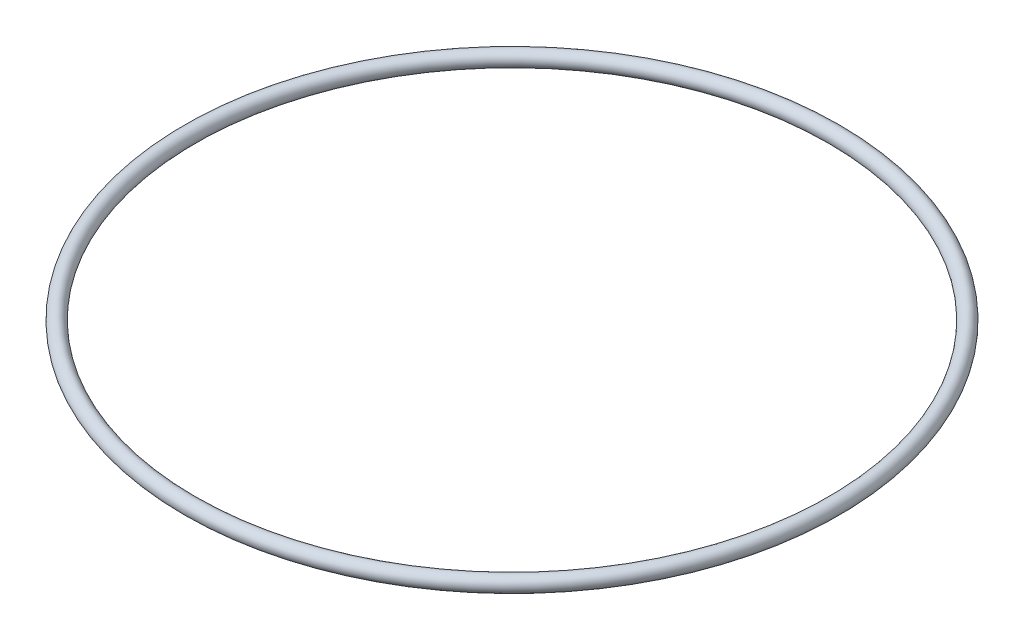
from build123d import *

# Parameters (mm, degrees)
ESQUISSE1_R = 1.5


with BuildPart() as part:
    # Esquisse1 → Base-R_volution (revolve)
    with BuildSketch(Plane.XY, mode=Mode.PRIVATE) as base_r_volution_sk:
        with Locations((64, 0)):
            Circle(ESQUISSE1_R)
    revolve(base_r_volution_sk.sketch.rotate(Axis((0, 1.5, 0), (0, -1, 0)), 90), axis=Axis((0, 1.5, 0), (0, -1, 0)))


solid = part.part
